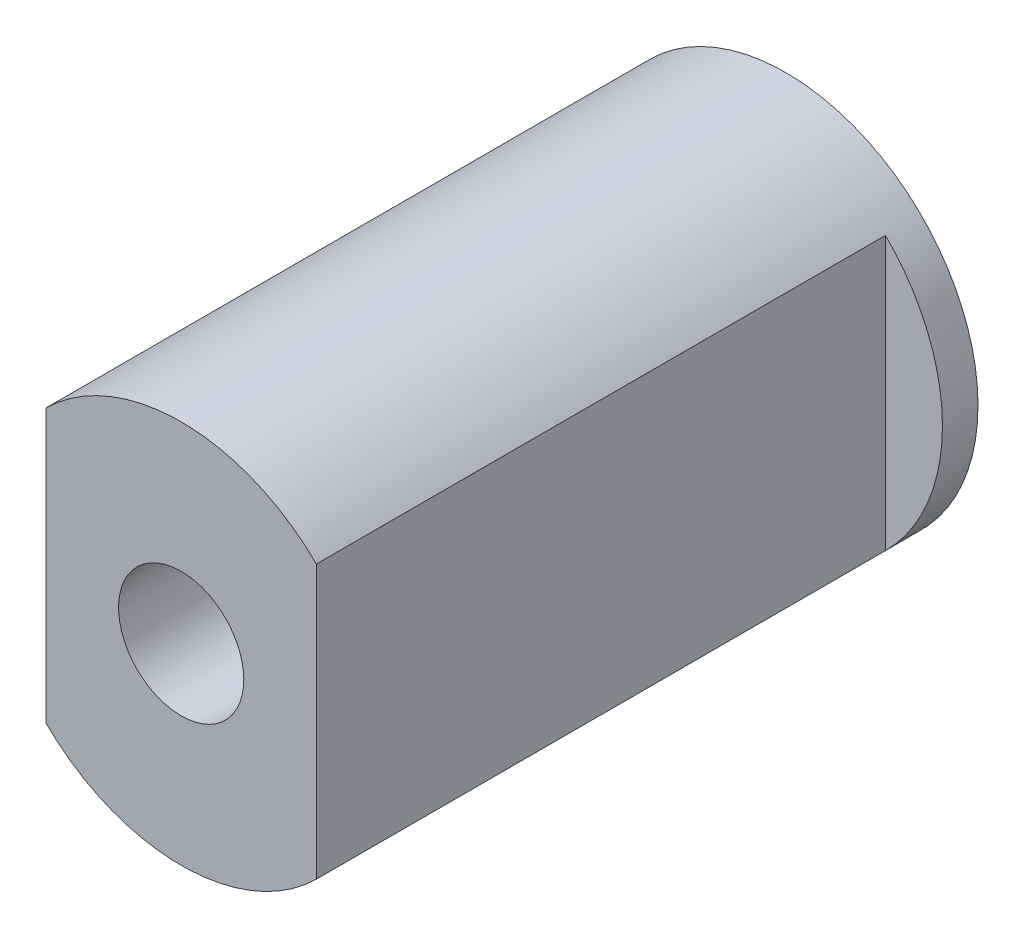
from build123d import *

# Parameters (mm, degrees)
SKETCH1_R          = 2.7
EXTRUDE1_DEPTH     = 0.5
EXTRUDE2_DEPTH     = 8
SKETCH3_R          = 0.88
CUT_EXTRUDE1_DEPTH = 8.5


with BuildPart() as part:
    # Sketch1 → Extrude1 (new body)
    with BuildSketch(Plane.XY):
        Circle(SKETCH1_R)
    extrude(amount=EXTRUDE1_DEPTH)

    # Sketch2 → Extrude2 (add)
    with BuildSketch(Plane.XY.offset(0.5)):
        with BuildLine():
            Line((1.9, -1.918332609), (1.9, 1.918332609))
            ThreePointArc((1.9, 1.918332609), (0, 2.7), (-1.9, 1.918332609))
            Line((-1.9, 1.918332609), (-1.9, -1.918332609))
            ThreePointArc((-1.9, -1.918332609), (0, -2.7), (1.9, -1.918332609))
        make_face()
    extrude(amount=EXTRUDE2_DEPTH)

    # Sketch3 → Cut-Extrude1 (cut)
    with BuildSketch(Plane.XY.offset(8.5)):
        Circle(SKETCH3_R)
    extrude(amount=-CUT_EXTRUDE1_DEPTH, mode=Mode.SUBTRACT)


solid = part.part
